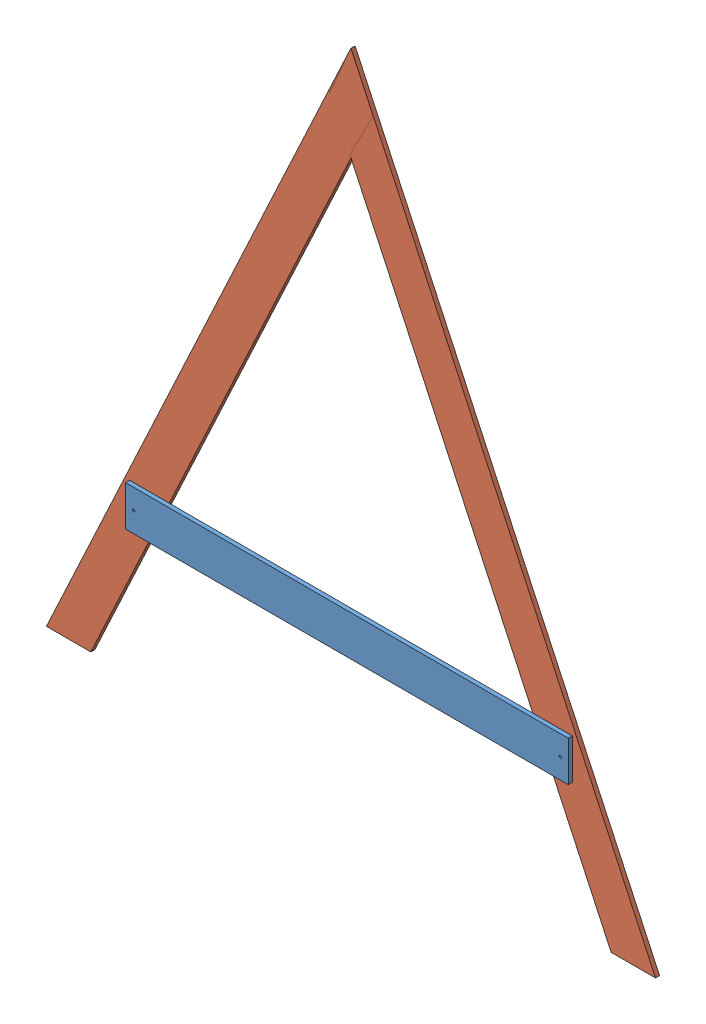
SolidWorks assembly Assem4.SLDASM, configuration Default (file format 14000). Lengths in mm.
Overall size (756.95 832.28 10).
3 component instances, 2 part files, 5 mates.
Components (placement in the parent):
- Patti1-1: Patti1.SLDPRT [Default] at (314.7634 332.8713 462.669) size (550 50 5)
- Frame-1: Frame.SLDPRT [Default] at (458.8006 533.4755 457.669) x (0.422618 -0.906308 0) z (0 0 1) size (895 50 5)
- Frame-4: Frame.SLDPRT [Default] at (170.7261 533.4755 462.669) x (-0.422618 -0.906308 0) z (0 0 -1) size (895 50 5)
Mates (geometry in assembly coordinates):
- Coincident1: coincident anti-aligned: plane of Patti1-1 through (314.7634 332.8713 462.669) normal (0 0 -1); plane of Frame-1 through (458.8006 533.4755 462.669) normal (0 0 1)
- Concentric1: concentric aligned: cylinder of Patti1-1 through (579.9284 332.8713 462.669) axis (0 0 1) radius 1.5; cylinder of Frame-1 through (579.9284 332.8713 452.669) axis (0 0 1) radius 1.5
- Coincident5: coincident anti-aligned: plane of Patti1-1 through (314.7634 332.8713 462.669) normal (0 0 -1); plane of Frame-4 through (170.7261 533.4755 462.669) normal (0 0 1)
- Concentric4: concentric anti-aligned: cylinder of Patti1-1 through (49.5984 332.8713 462.669) axis (0 0 1) radius 1.5; cylinder of Frame-4 through (49.5984 332.8713 467.669) axis (0 0 -1) radius 1.5
- Coincident6: coincident aligned: plane of Frame-1 through (638.0688 149.0337 462.669) normal (0 -1 0); plane of Frame-4 through (-8.5421 149.0337 457.669) normal (0 -1 0)
